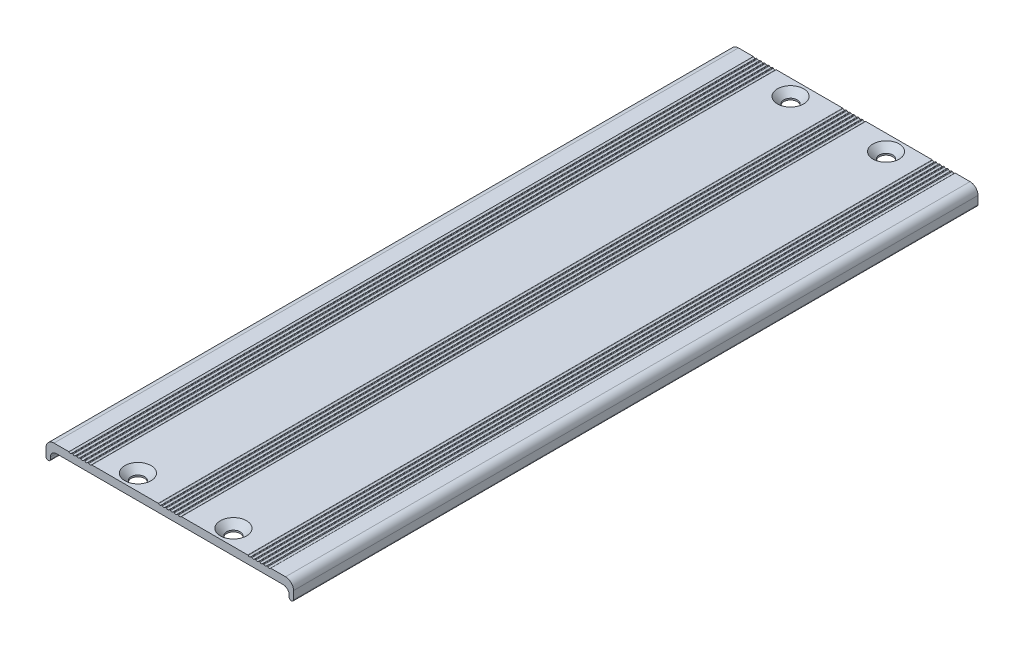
from build123d import *

# Parameters (mm, degrees)
EXTRUDE_1_DEPTH           = 86
HOLE_WIZARD_1_D           = 3.4
HOLE_WIZARD_1_CSINK_D     = 6.6
HOLE_WIZARD_1_CSINK_ANGLE = 90


with BuildPart() as part:
    # Model → Extrude 1 (new, symmetric)
    with BuildSketch(Plane.XY):
        with BuildLine():
            Line((1.533226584, 1.262025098), (1.633226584, 1.262025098))
            ThreePointArc((1.633226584, 1.262025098), (1.986779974, 1.408471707), (2.133226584, 1.762025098))
            Line((2.133226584, 1.762025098), (2.133226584, 2.262025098))
            ThreePointArc((2.133226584, 2.262025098), (2.572566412, 3.322685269), (3.633226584, 3.762025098))
            Line((3.633226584, 3.762025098), (60.633226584, 3.762025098))
            ThreePointArc((60.633226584, 3.762025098), (61.693886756, 3.322685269), (62.133226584, 2.262025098))
            Line((62.133226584, 2.262025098), (62.133226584, 1.762025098))
            ThreePointArc((62.133226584, 1.762025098), (62.279673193, 1.408471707), (62.633226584, 1.262025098))
            Line((62.633226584, 1.262025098), (62.733226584, 1.262025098))
            ThreePointArc((62.733226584, 1.262025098), (63.086779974, 1.408471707), (63.233226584, 1.762025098))
            Line((63.233226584, 1.762025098), (63.233226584, 3.762025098))
            ThreePointArc((63.233226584, 3.762025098), (62.647440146, 5.17623866), (61.233226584, 5.762025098))
            Line((61.233226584, 5.762025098), (57.479636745, 5.762025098))
            ThreePointArc((57.479636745, 5.762025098), (57.133226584, 5.562025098), (56.786816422, 5.762025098))
            Line((56.786816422, 5.762025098), (56.543104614, 5.762025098))
            ThreePointArc((56.543104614, 5.762025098), (56.490481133, 5.749871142), (56.448517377, 5.715871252))
            ThreePointArc((56.448517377, 5.715871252), (56.133226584, 5.562025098), (55.817935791, 5.715871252))
            ThreePointArc((55.817935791, 5.715871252), (55.775972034, 5.749871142), (55.723348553, 5.762025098))
            Line((55.723348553, 5.762025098), (55.543104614, 5.762025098))
            ThreePointArc((55.543104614, 5.762025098), (55.490481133, 5.749871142), (55.448517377, 5.715871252))
            ThreePointArc((55.448517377, 5.715871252), (55.133226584, 5.562025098), (54.817935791, 5.715871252))
            ThreePointArc((54.817935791, 5.715871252), (54.775972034, 5.749871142), (54.723348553, 5.762025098))
            Line((54.723348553, 5.762025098), (54.543104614, 5.762025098))
            ThreePointArc((54.543104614, 5.762025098), (54.490481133, 5.749871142), (54.448517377, 5.715871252))
            ThreePointArc((54.448517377, 5.715871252), (54.133226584, 5.562025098), (53.817935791, 5.715871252))
            ThreePointArc((53.817935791, 5.715871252), (53.775972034, 5.749871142), (53.723348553, 5.762025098))
            Line((53.723348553, 5.762025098), (53.543104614, 5.762025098))
            ThreePointArc((53.543104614, 5.762025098), (53.490481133, 5.749871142), (53.448517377, 5.715871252))
            ThreePointArc((53.448517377, 5.715871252), (53.133226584, 5.562025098), (52.817935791, 5.715871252))
            ThreePointArc((52.817935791, 5.715871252), (52.775972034, 5.749871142), (52.723348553, 5.762025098))
            Line((52.723348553, 5.762025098), (52.543104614, 5.762025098))
            ThreePointArc((52.543104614, 5.762025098), (52.490481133, 5.749871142), (52.448517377, 5.715871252))
            ThreePointArc((52.448517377, 5.715871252), (52.133226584, 5.562025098), (51.817935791, 5.715871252))
            ThreePointArc((51.817935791, 5.715871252), (51.775972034, 5.749871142), (51.723348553, 5.762025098))
            Line((51.723348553, 5.762025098), (35.043104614, 5.762025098))
            ThreePointArc((35.043104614, 5.762025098), (34.990481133, 5.749871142), (34.948517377, 5.715871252))
            ThreePointArc((34.948517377, 5.715871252), (34.633226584, 5.562025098), (34.317935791, 5.715871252))
            ThreePointArc((34.317935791, 5.715871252), (34.275972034, 5.749871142), (34.223348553, 5.762025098))
            Line((34.223348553, 5.762025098), (34.043104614, 5.762025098))
            ThreePointArc((34.043104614, 5.762025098), (33.990481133, 5.749871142), (33.948517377, 5.715871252))
            ThreePointArc((33.948517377, 5.715871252), (33.633226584, 5.562025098), (33.317935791, 5.715871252))
            ThreePointArc((33.317935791, 5.715871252), (33.275972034, 5.749871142), (33.223348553, 5.762025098))
            Line((33.223348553, 5.762025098), (33.043104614, 5.762025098))
            ThreePointArc((33.043104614, 5.762025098), (32.990481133, 5.749871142), (32.948517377, 5.715871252))
            ThreePointArc((32.948517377, 5.715871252), (32.633226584, 5.562025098), (32.317935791, 5.715871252))
            ThreePointArc((32.317935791, 5.715871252), (32.275972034, 5.749871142), (32.223348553, 5.762025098))
            Line((32.223348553, 5.762025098), (32.043104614, 5.762025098))
            ThreePointArc((32.043104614, 5.762025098), (31.990481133, 5.749871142), (31.948517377, 5.715871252))
            ThreePointArc((31.948517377, 5.715871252), (31.633226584, 5.562025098), (31.317935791, 5.715871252))
            ThreePointArc((31.317935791, 5.715871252), (31.275972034, 5.749871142), (31.223348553, 5.762025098))
            Line((31.223348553, 5.762025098), (31.043104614, 5.762025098))
            ThreePointArc((31.043104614, 5.762025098), (30.990481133, 5.749871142), (30.948517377, 5.715871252))
            ThreePointArc((30.948517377, 5.715871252), (30.633226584, 5.562025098), (30.317935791, 5.715871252))
            ThreePointArc((30.317935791, 5.715871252), (30.275972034, 5.749871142), (30.223348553, 5.762025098))
            Line((30.223348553, 5.762025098), (30.043104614, 5.762025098))
            ThreePointArc((30.043104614, 5.762025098), (29.990481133, 5.749871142), (29.948517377, 5.715871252))
            ThreePointArc((29.948517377, 5.715871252), (29.633226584, 5.562025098), (29.317935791, 5.715871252))
            ThreePointArc((29.317935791, 5.715871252), (29.275972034, 5.749871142), (29.223348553, 5.762025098))
            Line((29.223348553, 5.762025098), (12.543104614, 5.762025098))
            ThreePointArc((12.543104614, 5.762025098), (12.490481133, 5.749871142), (12.448517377, 5.715871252))
            ThreePointArc((12.448517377, 5.715871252), (12.133226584, 5.562025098), (11.817935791, 5.715871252))
            ThreePointArc((11.817935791, 5.715871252), (11.775972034, 5.749871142), (11.723348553, 5.762025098))
            Line((11.723348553, 5.762025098), (11.543104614, 5.762025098))
            ThreePointArc((11.543104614, 5.762025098), (11.490481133, 5.749871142), (11.448517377, 5.715871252))
            ThreePointArc((11.448517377, 5.715871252), (11.133226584, 5.562025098), (10.817935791, 5.715871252))
            ThreePointArc((10.817935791, 5.715871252), (10.775972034, 5.749871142), (10.723348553, 5.762025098))
            Line((10.723348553, 5.762025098), (10.543104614, 5.762025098))
            ThreePointArc((10.543104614, 5.762025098), (10.490481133, 5.749871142), (10.448517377, 5.715871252))
            ThreePointArc((10.448517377, 5.715871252), (10.133226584, 5.562025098), (9.817935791, 5.715871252))
            ThreePointArc((9.817935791, 5.715871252), (9.775972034, 5.749871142), (9.723348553, 5.762025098))
            Line((9.723348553, 5.762025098), (9.543104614, 5.762025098))
            ThreePointArc((9.543104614, 5.762025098), (9.490481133, 5.749871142), (9.448517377, 5.715871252))
            ThreePointArc((9.448517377, 5.715871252), (9.133226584, 5.562025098), (8.817935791, 5.715871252))
            ThreePointArc((8.817935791, 5.715871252), (8.775972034, 5.749871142), (8.723348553, 5.762025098))
            Line((8.723348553, 5.762025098), (8.543104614, 5.762025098))
            ThreePointArc((8.543104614, 5.762025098), (8.490481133, 5.749871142), (8.448517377, 5.715871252))
            ThreePointArc((8.448517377, 5.715871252), (8.133226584, 5.562025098), (7.817935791, 5.715871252))
            ThreePointArc((7.817935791, 5.715871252), (7.775972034, 5.749871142), (7.723348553, 5.762025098))
            Line((7.723348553, 5.762025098), (7.543104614, 5.762025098))
            ThreePointArc((7.543104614, 5.762025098), (7.490481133, 5.749871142), (7.448517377, 5.715871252))
            ThreePointArc((7.448517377, 5.715871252), (7.105394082, 5.562994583), (6.786816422, 5.762025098))
            Line((6.786816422, 5.762025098), (3.033226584, 5.762025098))
            ThreePointArc((3.033226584, 5.762025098), (1.619013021, 5.17623866), (1.033226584, 3.762025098))
            Line((1.033226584, 3.762025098), (1.033226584, 1.762025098))
            ThreePointArc((1.033226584, 1.762025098), (1.179673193, 1.408471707), (1.533226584, 1.262025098))
        make_face()
    extrude(amount=EXTRUDE_1_DEPTH, both=True)

    # Hole Wizard 1 (through all)
    with Locations(Plane(origin=(0, 5.762025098, 0), x_dir=(1, 0, 0), z_dir=(0, 1, 0))):
        with Locations((20.133226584, -82), (44.133226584, -82), (20.133226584, 82), (44.133226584, 82)):
            CounterSinkHole(HOLE_WIZARD_1_D / 2, HOLE_WIZARD_1_CSINK_D / 2, counter_sink_angle=HOLE_WIZARD_1_CSINK_ANGLE)


solid = part.part
